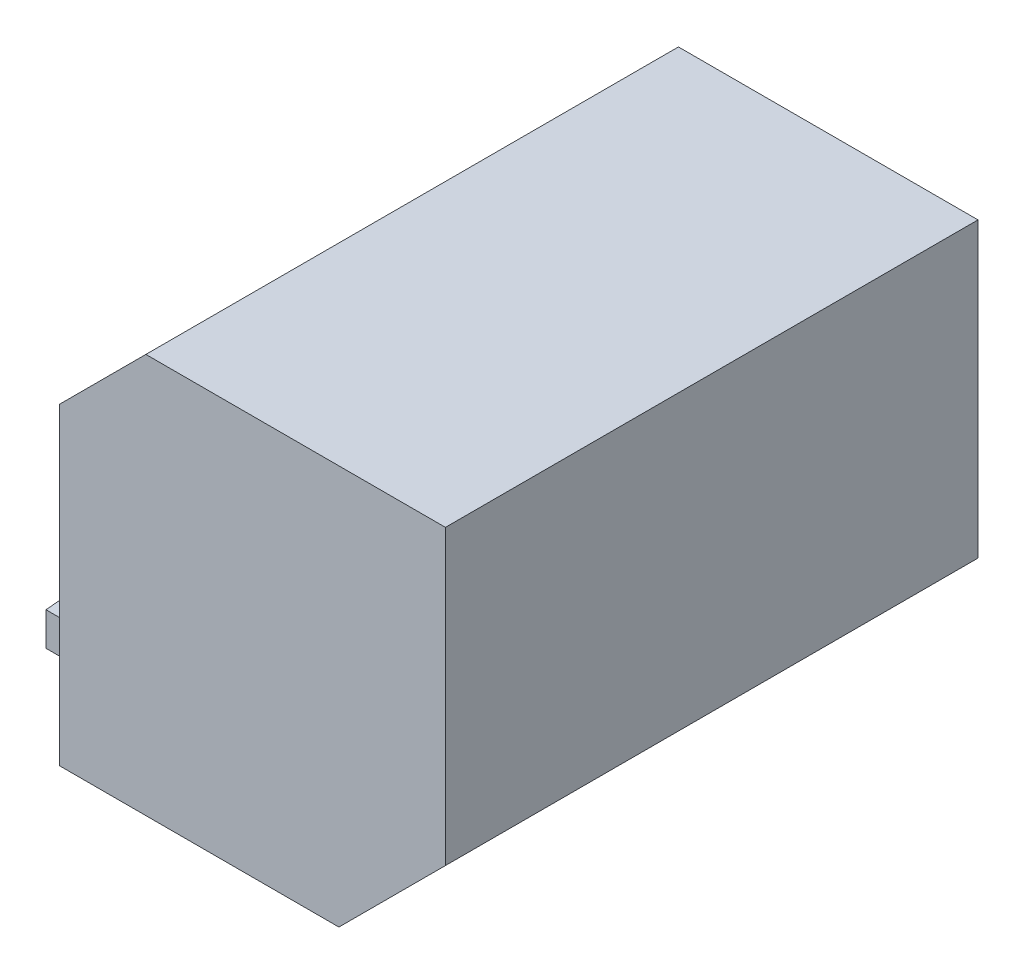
ISO-10303-21;
HEADER;
FILE_DESCRIPTION(('STEP AP214'),'2;1');
FILE_NAME('part.step','',(''),(''),'','','');
FILE_SCHEMA(('AUTOMOTIVE_DESIGN { 1 0 10303 214 1 1 1 1 }'));
ENDSEC;
DATA;
#1=APPLICATION_CONTEXT('core data for automotive mechanical design processes');
#2=APPLICATION_PROTOCOL_DEFINITION('international standard','automotive_design',2000,#1);
#3=PRODUCT_CONTEXT('',#1,'mechanical');
#4=PRODUCT('Part','Part','',(#3));
#5=PRODUCT_RELATED_PRODUCT_CATEGORY('part','',(#4));
#6=PRODUCT_DEFINITION_FORMATION('','',#4);
#7=PRODUCT_DEFINITION_CONTEXT('part definition',#1,'design');
#8=PRODUCT_DEFINITION('design','',#6,#7);
#9=PRODUCT_DEFINITION_SHAPE('','',#8);
#10=(LENGTH_UNIT() NAMED_UNIT(*) SI_UNIT(.MILLI.,.METRE.));
#11=(NAMED_UNIT(*) PLANE_ANGLE_UNIT() SI_UNIT($,.RADIAN.));
#12=(NAMED_UNIT(*) SI_UNIT($,.STERADIAN.) SOLID_ANGLE_UNIT());
#13=UNCERTAINTY_MEASURE_WITH_UNIT(LENGTH_MEASURE(1.E-05),#10,'distance_accuracy_value','');
#14=(GEOMETRIC_REPRESENTATION_CONTEXT(3) GLOBAL_UNCERTAINTY_ASSIGNED_CONTEXT((#13)) GLOBAL_UNIT_ASSIGNED_CONTEXT((#10,
#11,#12)) REPRESENTATION_CONTEXT('',''));
#15=CARTESIAN_POINT('',(0.,0.,0.));
#16=DIRECTION('',(0.,0.,1.));
#17=DIRECTION('',(1.,0.,0.));
#18=AXIS2_PLACEMENT_3D('',#15,#16,#17);
#19=CARTESIAN_POINT('',(5.,10.9965009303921,26.1199155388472));
#20=DIRECTION('',(0.,-0.995396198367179,-0.0958457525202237));
#21=DIRECTION('',(0.,0.0958457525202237,-0.995396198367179));
#22=AXIS2_PLACEMENT_3D('',#19,#20,#21);
#23=CYLINDRICAL_SURFACE('',#22,2.);
#24=CARTESIAN_POINT('',(5.,13.4849914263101,26.3595299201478));
#25=DIRECTION('',(0.,-0.995396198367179,-0.0958457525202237));
#26=DIRECTION('',(0.,0.0958457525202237,-0.995396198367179));
#27=AXIS2_PLACEMENT_3D('',#24,#25,#26);
#28=CIRCLE('',#27,2.);
#29=CARTESIAN_POINT('',(5.,13.6766829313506,24.3687375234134));
#30=VERTEX_POINT('',#29);
#31=EDGE_CURVE('E222',#30,#30,#28,.F.);
#32=ORIENTED_EDGE('',*,*,#31,.T.);
#33=EDGE_LOOP('',(#32));
#34=FACE_BOUND('',#33,.T.);
#35=CARTESIAN_POINT('',(5.,8.5080104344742,25.8803011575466));
#36=DIRECTION('',(0.,-0.995396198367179,-0.0958457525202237));
#37=DIRECTION('',(0.,0.0958457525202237,-0.995396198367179));
#38=AXIS2_PLACEMENT_3D('',#35,#36,#37);
#39=CIRCLE('',#38,2.);
#40=CARTESIAN_POINT('',(5.,8.69970193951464,23.8895087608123));
#41=VERTEX_POINT('',#40);
#42=EDGE_CURVE('E235',#41,#41,#39,.T.);
#43=ORIENTED_EDGE('',*,*,#42,.T.);
#44=EDGE_LOOP('',(#43));
#45=FACE_BOUND('',#44,.T.);
#46=ADVANCED_FACE('F17',(#34,#45),#23,.F.);
#47=CARTESIAN_POINT('',(5.,8.12112835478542,55.9818014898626));
#48=DIRECTION('',(0.,-0.995396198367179,-0.0958457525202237));
#49=DIRECTION('',(0.,0.0958457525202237,-0.995396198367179));
#50=AXIS2_PLACEMENT_3D('',#47,#48,#49);
#51=CYLINDRICAL_SURFACE('',#50,2.);
#52=CARTESIAN_POINT('',(5.,10.6096188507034,56.2214158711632));
#53=DIRECTION('',(0.,-0.995396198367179,-0.0958457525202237));
#54=DIRECTION('',(0.,0.0958457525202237,-0.995396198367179));
#55=AXIS2_PLACEMENT_3D('',#52,#53,#54);
#56=CIRCLE('',#55,2.);
#57=CARTESIAN_POINT('',(5.,10.8013103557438,54.2306234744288));
#58=VERTEX_POINT('',#57);
#59=EDGE_CURVE('E199',#58,#58,#56,.F.);
#60=ORIENTED_EDGE('',*,*,#59,.T.);
#61=EDGE_LOOP('',(#60));
#62=FACE_BOUND('',#61,.T.);
#63=CARTESIAN_POINT('',(5.,5.63263785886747,55.742187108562));
#64=DIRECTION('',(0.,-0.995396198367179,-0.0958457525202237));
#65=DIRECTION('',(0.,0.0958457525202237,-0.995396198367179));
#66=AXIS2_PLACEMENT_3D('',#63,#64,#65);
#67=CIRCLE('',#66,2.);
#68=CARTESIAN_POINT('',(5.,5.82432936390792,53.7513947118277));
#69=VERTEX_POINT('',#68);
#70=EDGE_CURVE('E20',#69,#69,#67,.T.);
#71=ORIENTED_EDGE('',*,*,#70,.T.);
#72=EDGE_LOOP('',(#71));
#73=FACE_BOUND('',#72,.T.);
#74=ADVANCED_FACE('F272',(#62,#73),#51,.F.);
#75=CARTESIAN_POINT('',(0.,60.,0.));
#76=DIRECTION('',(-1.,0.,0.));
#77=DIRECTION('',(0.,0.,1.));
#78=AXIS2_PLACEMENT_3D('',#75,#76,#77);
#79=PLANE('',#78);
#80=DIRECTION('',(0.,1.,0.));
#81=VECTOR('',#80,1.);
#82=CARTESIAN_POINT('',(0.,0.,70.));
#83=LINE('',#82,#81);
#84=CARTESIAN_POINT('',(0.,4.25976662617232,70.));
#85=VERTEX_POINT('',#84);
#86=CARTESIAN_POINT('',(0.,9.28289209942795,70.));
#87=VERTEX_POINT('',#86);
#88=EDGE_CURVE('E215',#85,#87,#83,.T.);
#89=ORIENTED_EDGE('',*,*,#88,.T.);
#90=DIRECTION('',(0.,0.0958457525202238,-0.995396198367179));
#91=VECTOR('',#90,1.);
#92=CARTESIAN_POINT('',(0.,7.61909765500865,87.2791659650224));
#93=LINE('',#92,#91);
#94=CARTESIAN_POINT('',(0.,15.9769809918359,0.479228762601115));
#95=VERTEX_POINT('',#94);
#96=EDGE_CURVE('E209',#87,#95,#93,.T.);
#97=ORIENTED_EDGE('',*,*,#96,.T.);
#98=DIRECTION('',(0.,-0.995396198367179,-0.0958457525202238));
#99=VECTOR('',#98,1.);
#100=CARTESIAN_POINT('',(0.,15.9769809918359,0.479228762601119));
#101=LINE('',#100,#99);
#102=CARTESIAN_POINT('',(0.,11.,0.));
#103=VERTEX_POINT('',#102);
#104=EDGE_CURVE('E150',#95,#103,#101,.T.);
#105=ORIENTED_EDGE('',*,*,#104,.T.);
#106=DIRECTION('',(0.,-0.0958457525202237,0.995396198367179));
#107=VECTOR('',#106,1.);
#108=CARTESIAN_POINT('',(0.,11.,0.));
#109=LINE('',#108,#107);
#110=EDGE_CURVE('E229',#103,#85,#109,.T.);
#111=ORIENTED_EDGE('',*,*,#110,.T.);
#112=EDGE_LOOP('',(#89,#97,#105,#111));
#113=FACE_BOUND('',#112,.T.);
#114=ADVANCED_FACE('F278',(#113),#79,.T.);
#115=CARTESIAN_POINT('',(0.,11.,0.));
#116=DIRECTION('',(0.,0.995396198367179,0.0958457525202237));
#117=DIRECTION('',(0.,-0.0958457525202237,0.995396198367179));
#118=AXIS2_PLACEMENT_3D('',#115,#116,#117);
#119=PLANE('',#118);
#120=ORIENTED_EDGE('',*,*,#42,.F.);
#121=EDGE_LOOP('',(#120));
#122=FACE_BOUND('',#121,.T.);
#123=ORIENTED_EDGE('',*,*,#70,.F.);
#124=EDGE_LOOP('',(#123));
#125=FACE_BOUND('',#124,.T.);
#126=DIRECTION('',(1.,0.,0.));
#127=VECTOR('',#126,1.);
#128=CARTESIAN_POINT('',(0.,11.,0.));
#129=LINE('',#128,#127);
#130=CARTESIAN_POINT('',(12.,11.,0.));
#131=VERTEX_POINT('',#130);
#132=EDGE_CURVE('E195',#103,#131,#129,.T.);
#133=ORIENTED_EDGE('',*,*,#132,.T.);
#134=DIRECTION('',(0.,-0.0958457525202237,0.995396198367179));
#135=VECTOR('',#134,1.);
#136=CARTESIAN_POINT('',(12.,11.,0.));
#137=LINE('',#136,#135);
#138=CARTESIAN_POINT('',(12.,4.25976662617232,70.));
#139=VERTEX_POINT('',#138);
#140=EDGE_CURVE('E256',#131,#139,#137,.T.);
#141=ORIENTED_EDGE('',*,*,#140,.T.);
#142=DIRECTION('',(1.,0.,0.));
#143=VECTOR('',#142,1.);
#144=CARTESIAN_POINT('',(0.,4.25976662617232,70.));
#145=LINE('',#144,#143);
#146=EDGE_CURVE('E210',#139,#85,#145,.F.);
#147=ORIENTED_EDGE('',*,*,#146,.T.);
#148=ORIENTED_EDGE('',*,*,#110,.F.);
#149=EDGE_LOOP('',(#133,#141,#147,#148));
#150=FACE_BOUND('',#149,.T.);
#151=ADVANCED_FACE('F274',(#122,#125,#150),#119,.F.);
#152=CARTESIAN_POINT('',(0.,0.,70.));
#153=DIRECTION('',(0.,0.,-1.));
#154=DIRECTION('',(0.,1.,0.));
#155=AXIS2_PLACEMENT_3D('',#152,#153,#154);
#156=PLANE('',#155);
#157=DIRECTION('',(0.,1.,0.));
#158=VECTOR('',#157,1.);
#159=CARTESIAN_POINT('',(12.,0.,70.));
#160=LINE('',#159,#158);
#161=CARTESIAN_POINT('',(12.,9.28289209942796,70.));
#162=VERTEX_POINT('',#161);
#163=EDGE_CURVE('E253',#139,#162,#160,.T.);
#164=ORIENTED_EDGE('',*,*,#163,.T.);
#165=DIRECTION('',(1.,0.,0.));
#166=VECTOR('',#165,1.);
#167=CARTESIAN_POINT('',(0.,9.28289209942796,70.));
#168=LINE('',#167,#166);
#169=EDGE_CURVE('E206',#162,#87,#168,.F.);
#170=ORIENTED_EDGE('',*,*,#169,.T.);
#171=ORIENTED_EDGE('',*,*,#88,.F.);
#172=ORIENTED_EDGE('',*,*,#146,.F.);
#173=EDGE_LOOP('',(#164,#170,#171,#172));
#174=FACE_BOUND('',#173,.T.);
#175=ADVANCED_FACE('F277',(#174),#156,.F.);
#176=CARTESIAN_POINT('',(0.,7.61909765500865,87.2791659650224));
#177=DIRECTION('',(0.,-0.995396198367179,-0.0958457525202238));
#178=DIRECTION('',(0.,0.0958457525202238,-0.995396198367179));
#179=AXIS2_PLACEMENT_3D('',#176,#177,#178);
#180=PLANE('',#179);
#181=ORIENTED_EDGE('',*,*,#59,.F.);
#182=EDGE_LOOP('',(#181));
#183=FACE_BOUND('',#182,.T.);
#184=ORIENTED_EDGE('',*,*,#31,.F.);
#185=EDGE_LOOP('',(#184));
#186=FACE_BOUND('',#185,.T.);
#187=ORIENTED_EDGE('',*,*,#96,.F.);
#188=ORIENTED_EDGE('',*,*,#169,.F.);
#189=DIRECTION('',(0.,0.0958457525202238,-0.995396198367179));
#190=VECTOR('',#189,1.);
#191=CARTESIAN_POINT('',(12.,7.61909765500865,87.2791659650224));
#192=LINE('',#191,#190);
#193=CARTESIAN_POINT('',(12.,15.9769809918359,0.479228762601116));
#194=VERTEX_POINT('',#193);
#195=EDGE_CURVE('E250',#162,#194,#192,.T.);
#196=ORIENTED_EDGE('',*,*,#195,.T.);
#197=DIRECTION('',(1.,0.,0.));
#198=VECTOR('',#197,1.);
#199=CARTESIAN_POINT('',(0.,15.9769809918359,0.479228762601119));
#200=LINE('',#199,#198);
#201=EDGE_CURVE('E198',#194,#95,#200,.F.);
#202=ORIENTED_EDGE('',*,*,#201,.T.);
#203=EDGE_LOOP('',(#187,#188,#196,#202));
#204=FACE_BOUND('',#203,.T.);
#205=ADVANCED_FACE('F291',(#183,#186,#204),#180,.F.);
#206=CARTESIAN_POINT('',(0.,15.9769809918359,0.479228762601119));
#207=DIRECTION('',(0.,-0.0958457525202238,0.995396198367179));
#208=DIRECTION('',(0.,-0.995396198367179,-0.0958457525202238));
#209=AXIS2_PLACEMENT_3D('',#206,#207,#208);
#210=PLANE('',#209);
#211=ORIENTED_EDGE('',*,*,#201,.F.);
#212=DIRECTION('',(0.,-0.995396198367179,-0.0958457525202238));
#213=VECTOR('',#212,1.);
#214=CARTESIAN_POINT('',(12.,15.9769809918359,0.479228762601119));
#215=LINE('',#214,#213);
#216=EDGE_CURVE('E189',#194,#131,#215,.T.);
#217=ORIENTED_EDGE('',*,*,#216,.T.);
#218=ORIENTED_EDGE('',*,*,#132,.F.);
#219=ORIENTED_EDGE('',*,*,#104,.F.);
#220=EDGE_LOOP('',(#211,#217,#218,#219));
#221=FACE_BOUND('',#220,.T.);
#222=ADVANCED_FACE('F285',(#221),#210,.F.);
#223=CARTESIAN_POINT('',(35.,30.,80.));
#224=DIRECTION('',(0.,0.,1.));
#225=DIRECTION('',(1.,0.,0.));
#226=AXIS2_PLACEMENT_3D('',#223,#224,#225);
#227=PLANE('',#226);
#228=DIRECTION('',(0.,1.,0.));
#229=VECTOR('',#228,1.);
#230=CARTESIAN_POINT('',(70.,0.,80.));
#231=LINE('',#230,#229);
#232=CARTESIAN_POINT('',(70.,60.,80.));
#233=VERTEX_POINT('',#232);
#234=CARTESIAN_POINT('',(70.,16.,80.));
#235=VERTEX_POINT('',#234);
#236=EDGE_CURVE('E154',#233,#235,#231,.F.);
#237=ORIENTED_EDGE('',*,*,#236,.F.);
#238=DIRECTION('',(1.,0.,0.));
#239=VECTOR('',#238,1.);
#240=CARTESIAN_POINT('',(70.,60.,80.));
#241=LINE('',#240,#239);
#242=CARTESIAN_POINT('',(25.,60.,80.));
#243=VERTEX_POINT('',#242);
#244=EDGE_CURVE('E134',#243,#233,#241,.T.);
#245=ORIENTED_EDGE('',*,*,#244,.F.);
#246=DIRECTION('',(-0.707106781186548,-0.707106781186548,0.));
#247=VECTOR('',#246,1.);
#248=CARTESIAN_POINT('',(15.,50.,80.));
#249=LINE('',#248,#247);
#250=CARTESIAN_POINT('',(12.,47.,80.));
#251=VERTEX_POINT('',#250);
#252=EDGE_CURVE('E124',#251,#243,#249,.F.);
#253=ORIENTED_EDGE('',*,*,#252,.F.);
#254=DIRECTION('',(0.,1.,0.));
#255=VECTOR('',#254,1.);
#256=CARTESIAN_POINT('',(12.,30.,80.));
#257=LINE('',#256,#255);
#258=CARTESIAN_POINT('',(12.,0.,80.));
#259=VERTEX_POINT('',#258);
#260=EDGE_CURVE('E110',#251,#259,#257,.F.);
#261=ORIENTED_EDGE('',*,*,#260,.T.);
#262=DIRECTION('',(1.,0.,0.));
#263=VECTOR('',#262,1.);
#264=CARTESIAN_POINT('',(0.,0.,80.));
#265=LINE('',#264,#263);
#266=CARTESIAN_POINT('',(54.,0.,80.));
#267=VERTEX_POINT('',#266);
#268=EDGE_CURVE('E186',#267,#259,#265,.F.);
#269=ORIENTED_EDGE('',*,*,#268,.F.);
#270=DIRECTION('',(0.707106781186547,0.707106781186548,0.));
#271=VECTOR('',#270,1.);
#272=CARTESIAN_POINT('',(62.,8.,80.));
#273=LINE('',#272,#271);
#274=EDGE_CURVE('E170',#235,#267,#273,.F.);
#275=ORIENTED_EDGE('',*,*,#274,.F.);
#276=EDGE_LOOP('',(#237,#245,#253,#261,#269,#275));
#277=FACE_BOUND('',#276,.T.);
#278=ADVANCED_FACE('F133',(#277),#227,.T.);
#279=CARTESIAN_POINT('',(0.,0.,70.));
#280=DIRECTION('',(0.,0.,-1.));
#281=DIRECTION('',(0.,1.,0.));
#282=AXIS2_PLACEMENT_3D('',#279,#280,#281);
#283=PLANE('',#282);
#284=DIRECTION('',(0.,1.,0.));
#285=VECTOR('',#284,1.);
#286=CARTESIAN_POINT('',(5.,42.2733158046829,70.));
#287=LINE('',#286,#285);
#288=CARTESIAN_POINT('',(5.,40.,70.));
#289=VERTEX_POINT('',#288);
#290=CARTESIAN_POINT('',(5.,21.3383932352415,70.));
#291=VERTEX_POINT('',#290);
#292=EDGE_CURVE('E146',#289,#291,#287,.F.);
#293=ORIENTED_EDGE('',*,*,#292,.T.);
#294=DIRECTION('',(1.,0.,0.));
#295=VECTOR('',#294,1.);
#296=CARTESIAN_POINT('',(0.,21.3383932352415,70.));
#297=LINE('',#296,#295);
#298=CARTESIAN_POINT('',(12.,21.3383932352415,70.));
#299=VERTEX_POINT('',#298);
#300=EDGE_CURVE('E149',#291,#299,#297,.T.);
#301=ORIENTED_EDGE('',*,*,#300,.T.);
#302=DIRECTION('',(0.,1.,0.));
#303=VECTOR('',#302,1.);
#304=CARTESIAN_POINT('',(12.,0.,70.));
#305=LINE('',#304,#303);
#306=CARTESIAN_POINT('',(12.,47.,70.));
#307=VERTEX_POINT('',#306);
#308=EDGE_CURVE('E259',#299,#307,#305,.T.);
#309=ORIENTED_EDGE('',*,*,#308,.T.);
#310=DIRECTION('',(-0.707106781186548,-0.707106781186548,0.));
#311=VECTOR('',#310,1.);
#312=CARTESIAN_POINT('',(15.,50.,70.));
#313=LINE('',#312,#311);
#314=EDGE_CURVE('E128',#289,#307,#313,.F.);
#315=ORIENTED_EDGE('',*,*,#314,.F.);
#316=EDGE_LOOP('',(#293,#301,#309,#315));
#317=FACE_BOUND('',#316,.T.);
#318=ADVANCED_FACE('F349',(#317),#283,.F.);
#319=CARTESIAN_POINT('',(5.,42.2733158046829,36.1185425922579));
#320=DIRECTION('',(1.,0.,0.));
#321=DIRECTION('',(0.,0.,-1.));
#322=AXIS2_PLACEMENT_3D('',#319,#320,#321);
#323=PLANE('',#322);
#324=DIRECTION('',(0.,1.,0.));
#325=VECTOR('',#324,1.);
#326=CARTESIAN_POINT('',(5.,30.,0.));
#327=LINE('',#326,#325);
#328=CARTESIAN_POINT('',(5.,40.,0.));
#329=VERTEX_POINT('',#328);
#330=CARTESIAN_POINT('',(5.,28.0786266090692,0.));
#331=VERTEX_POINT('',#330);
#332=EDGE_CURVE('E130',#329,#331,#327,.F.);
#333=ORIENTED_EDGE('',*,*,#332,.T.);
#334=DIRECTION('',(0.,-0.0958457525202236,0.995396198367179));
#335=VECTOR('',#334,1.);
#336=CARTESIAN_POINT('',(5.,28.4544603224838,-3.90318234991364));
#337=LINE('',#336,#335);
#338=EDGE_CURVE('E121',#331,#291,#337,.T.);
#339=ORIENTED_EDGE('',*,*,#338,.T.);
#340=ORIENTED_EDGE('',*,*,#292,.F.);
#341=DIRECTION('',(0.,0.,1.));
#342=VECTOR('',#341,1.);
#343=CARTESIAN_POINT('',(5.,40.,18.0592712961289));
#344=LINE('',#343,#342);
#345=EDGE_CURVE('E137',#329,#289,#344,.T.);
#346=ORIENTED_EDGE('',*,*,#345,.F.);
#347=EDGE_LOOP('',(#333,#339,#340,#346));
#348=FACE_BOUND('',#347,.T.);
#349=ADVANCED_FACE('F345',(#348),#323,.F.);
#350=CARTESIAN_POINT('',(0.,28.4544603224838,-3.90318234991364));
#351=DIRECTION('',(0.,0.995396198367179,0.0958457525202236));
#352=DIRECTION('',(0.,-0.0958457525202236,0.995396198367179));
#353=AXIS2_PLACEMENT_3D('',#350,#351,#352);
#354=PLANE('',#353);
#355=DIRECTION('',(1.,0.,0.));
#356=VECTOR('',#355,1.);
#357=CARTESIAN_POINT('',(35.,28.0786266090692,0.));
#358=LINE('',#357,#356);
#359=CARTESIAN_POINT('',(12.,28.0786266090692,0.));
#360=VERTEX_POINT('',#359);
#361=EDGE_CURVE('E245',#331,#360,#358,.T.);
#362=ORIENTED_EDGE('',*,*,#361,.T.);
#363=DIRECTION('',(0.,-0.0958457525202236,0.995396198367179));
#364=VECTOR('',#363,1.);
#365=CARTESIAN_POINT('',(12.,28.4544603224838,-3.90318234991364));
#366=LINE('',#365,#364);
#367=EDGE_CURVE('E120',#360,#299,#366,.T.);
#368=ORIENTED_EDGE('',*,*,#367,.T.);
#369=ORIENTED_EDGE('',*,*,#300,.F.);
#370=ORIENTED_EDGE('',*,*,#338,.F.);
#371=EDGE_LOOP('',(#362,#368,#369,#370));
#372=FACE_BOUND('',#371,.T.);
#373=ADVANCED_FACE('F342',(#372),#354,.F.);
#374=CARTESIAN_POINT('',(12.,3.89588081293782,33.4837201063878));
#375=DIRECTION('',(1.,0.,0.));
#376=DIRECTION('',(0.,0.,-1.));
#377=AXIS2_PLACEMENT_3D('',#374,#375,#376);
#378=PLANE('',#377);
#379=ORIENTED_EDGE('',*,*,#195,.F.);
#380=ORIENTED_EDGE('',*,*,#163,.F.);
#381=ORIENTED_EDGE('',*,*,#140,.F.);
#382=ORIENTED_EDGE('',*,*,#216,.F.);
#383=EDGE_LOOP('',(#379,#380,#381,#382));
#384=FACE_BOUND('',#383,.T.);
#385=ORIENTED_EDGE('',*,*,#308,.F.);
#386=ORIENTED_EDGE('',*,*,#367,.F.);
#387=DIRECTION('',(0.,1.,0.));
#388=VECTOR('',#387,1.);
#389=CARTESIAN_POINT('',(12.,3.89588081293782,0.));
#390=LINE('',#389,#388);
#391=CARTESIAN_POINT('',(12.,0.,0.));
#392=VERTEX_POINT('',#391);
#393=EDGE_CURVE('E244',#360,#392,#390,.F.);
#394=ORIENTED_EDGE('',*,*,#393,.T.);
#395=DIRECTION('',(0.,0.,-1.));
#396=VECTOR('',#395,1.);
#397=CARTESIAN_POINT('',(12.,0.,0.));
#398=LINE('',#397,#396);
#399=EDGE_CURVE('E116',#259,#392,#398,.T.);
#400=ORIENTED_EDGE('',*,*,#399,.F.);
#401=ORIENTED_EDGE('',*,*,#260,.F.);
#402=DIRECTION('',(0.,0.,1.));
#403=VECTOR('',#402,1.);
#404=CARTESIAN_POINT('',(12.,47.,18.0592712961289));
#405=LINE('',#404,#403);
#406=EDGE_CURVE('E114',#307,#251,#405,.T.);
#407=ORIENTED_EDGE('',*,*,#406,.F.);
#408=EDGE_LOOP('',(#385,#386,#394,#400,#401,#407));
#409=FACE_BOUND('',#408,.T.);
#410=ADVANCED_FACE('F113',(#384,#409),#378,.F.);
#411=CARTESIAN_POINT('',(0.,0.,0.));
#412=DIRECTION('',(0.,-1.,0.));
#413=DIRECTION('',(0.,0.,-1.));
#414=AXIS2_PLACEMENT_3D('',#411,#412,#413);
#415=PLANE('',#414);
#416=ORIENTED_EDGE('',*,*,#399,.T.);
#417=DIRECTION('',(1.,0.,0.));
#418=VECTOR('',#417,1.);
#419=CARTESIAN_POINT('',(35.,0.,0.));
#420=LINE('',#419,#418);
#421=CARTESIAN_POINT('',(54.,0.,0.));
#422=VERTEX_POINT('',#421);
#423=EDGE_CURVE('E183',#392,#422,#420,.T.);
#424=ORIENTED_EDGE('',*,*,#423,.T.);
#425=DIRECTION('',(0.,0.,1.));
#426=VECTOR('',#425,1.);
#427=CARTESIAN_POINT('',(54.,0.,0.));
#428=LINE('',#427,#426);
#429=EDGE_CURVE('E167',#267,#422,#428,.F.);
#430=ORIENTED_EDGE('',*,*,#429,.F.);
#431=ORIENTED_EDGE('',*,*,#268,.T.);
#432=EDGE_LOOP('',(#416,#424,#430,#431));
#433=FACE_BOUND('',#432,.T.);
#434=ADVANCED_FACE('F335',(#433),#415,.T.);
#435=CARTESIAN_POINT('',(62.,8.,0.));
#436=DIRECTION('',(0.707106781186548,-0.707106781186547,0.));
#437=DIRECTION('',(0.707106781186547,0.707106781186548,0.));
#438=AXIS2_PLACEMENT_3D('',#435,#436,#437);
#439=PLANE('',#438);
#440=DIRECTION('',(0.707106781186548,0.707106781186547,0.));
#441=VECTOR('',#440,1.);
#442=CARTESIAN_POINT('',(54.,0.,0.));
#443=LINE('',#442,#441);
#444=CARTESIAN_POINT('',(70.,16.,0.));
#445=VERTEX_POINT('',#444);
#446=EDGE_CURVE('E178',#422,#445,#443,.T.);
#447=ORIENTED_EDGE('',*,*,#446,.T.);
#448=DIRECTION('',(0.,0.,-1.));
#449=VECTOR('',#448,1.);
#450=CARTESIAN_POINT('',(70.,16.,0.));
#451=LINE('',#450,#449);
#452=EDGE_CURVE('E161',#235,#445,#451,.T.);
#453=ORIENTED_EDGE('',*,*,#452,.F.);
#454=ORIENTED_EDGE('',*,*,#274,.T.);
#455=ORIENTED_EDGE('',*,*,#429,.T.);
#456=EDGE_LOOP('',(#447,#453,#454,#455));
#457=FACE_BOUND('',#456,.T.);
#458=ADVANCED_FACE('F331',(#457),#439,.T.);
#459=CARTESIAN_POINT('',(70.,0.,0.));
#460=DIRECTION('',(1.,0.,0.));
#461=DIRECTION('',(0.,0.,-1.));
#462=AXIS2_PLACEMENT_3D('',#459,#460,#461);
#463=PLANE('',#462);
#464=DIRECTION('',(0.,0.,1.));
#465=VECTOR('',#464,1.);
#466=CARTESIAN_POINT('',(70.,60.,0.));
#467=LINE('',#466,#465);
#468=CARTESIAN_POINT('',(70.,60.,0.));
#469=VERTEX_POINT('',#468);
#470=EDGE_CURVE('E135',#233,#469,#467,.F.);
#471=ORIENTED_EDGE('',*,*,#470,.F.);
#472=ORIENTED_EDGE('',*,*,#236,.T.);
#473=ORIENTED_EDGE('',*,*,#452,.T.);
#474=DIRECTION('',(0.,1.,0.));
#475=VECTOR('',#474,1.);
#476=CARTESIAN_POINT('',(70.,30.,0.));
#477=LINE('',#476,#475);
#478=EDGE_CURVE('E174',#445,#469,#477,.T.);
#479=ORIENTED_EDGE('',*,*,#478,.T.);
#480=EDGE_LOOP('',(#471,#472,#473,#479));
#481=FACE_BOUND('',#480,.T.);
#482=ADVANCED_FACE('F327',(#481),#463,.T.);
#483=CARTESIAN_POINT('',(70.,60.,0.));
#484=DIRECTION('',(0.,1.,0.));
#485=DIRECTION('',(0.,0.,1.));
#486=AXIS2_PLACEMENT_3D('',#483,#484,#485);
#487=PLANE('',#486);
#488=ORIENTED_EDGE('',*,*,#470,.T.);
#489=DIRECTION('',(1.,0.,0.));
#490=VECTOR('',#489,1.);
#491=CARTESIAN_POINT('',(35.,60.,0.));
#492=LINE('',#491,#490);
#493=CARTESIAN_POINT('',(25.,60.,0.));
#494=VERTEX_POINT('',#493);
#495=EDGE_CURVE('E177',#469,#494,#492,.F.);
#496=ORIENTED_EDGE('',*,*,#495,.T.);
#497=DIRECTION('',(0.,0.,1.));
#498=VECTOR('',#497,1.);
#499=CARTESIAN_POINT('',(25.,60.,18.0592712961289));
#500=LINE('',#499,#498);
#501=EDGE_CURVE('E35',#243,#494,#500,.F.);
#502=ORIENTED_EDGE('',*,*,#501,.F.);
#503=ORIENTED_EDGE('',*,*,#244,.T.);
#504=EDGE_LOOP('',(#488,#496,#502,#503));
#505=FACE_BOUND('',#504,.T.);
#506=ADVANCED_FACE('F324',(#505),#487,.T.);
#507=CARTESIAN_POINT('',(15.,50.,18.0592712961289));
#508=DIRECTION('',(-0.707106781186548,0.707106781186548,0.));
#509=DIRECTION('',(-0.707106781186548,-0.707106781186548,0.));
#510=AXIS2_PLACEMENT_3D('',#507,#508,#509);
#511=PLANE('',#510);
#512=ORIENTED_EDGE('',*,*,#314,.T.);
#513=ORIENTED_EDGE('',*,*,#406,.T.);
#514=ORIENTED_EDGE('',*,*,#252,.T.);
#515=ORIENTED_EDGE('',*,*,#501,.T.);
#516=DIRECTION('',(-0.707106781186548,-0.707106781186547,0.));
#517=VECTOR('',#516,1.);
#518=CARTESIAN_POINT('',(25.,60.,0.));
#519=LINE('',#518,#517);
#520=EDGE_CURVE('E243',#494,#329,#519,.T.);
#521=ORIENTED_EDGE('',*,*,#520,.T.);
#522=ORIENTED_EDGE('',*,*,#345,.T.);
#523=EDGE_LOOP('',(#512,#513,#514,#515,#521,#522));
#524=FACE_BOUND('',#523,.T.);
#525=ADVANCED_FACE('F123',(#524),#511,.T.);
#526=CARTESIAN_POINT('',(35.,30.,0.));
#527=DIRECTION('',(0.,0.,1.));
#528=DIRECTION('',(1.,0.,0.));
#529=AXIS2_PLACEMENT_3D('',#526,#527,#528);
#530=PLANE('',#529);
#531=CARTESIAN_POINT('',(40.,30.,4.87717505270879E-12));
#532=DIRECTION('',(0.,0.,-1.));
#533=DIRECTION('',(-1.,0.,0.));
#534=AXIS2_PLACEMENT_3D('',#531,#532,#533);
#535=CIRCLE('',#534,25.7735026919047);
#536=CARTESIAN_POINT('',(14.2264973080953,30.,4.87717505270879E-12));
#537=VERTEX_POINT('',#536);
#538=EDGE_CURVE('E240',#537,#537,#535,.F.);
#539=ORIENTED_EDGE('',*,*,#538,.T.);
#540=EDGE_LOOP('',(#539));
#541=FACE_BOUND('',#540,.T.);
#542=ORIENTED_EDGE('',*,*,#495,.F.);
#543=ORIENTED_EDGE('',*,*,#478,.F.);
#544=ORIENTED_EDGE('',*,*,#446,.F.);
#545=ORIENTED_EDGE('',*,*,#423,.F.);
#546=ORIENTED_EDGE('',*,*,#393,.F.);
#547=ORIENTED_EDGE('',*,*,#361,.F.);
#548=ORIENTED_EDGE('',*,*,#332,.F.);
#549=ORIENTED_EDGE('',*,*,#520,.F.);
#550=EDGE_LOOP('',(#542,#543,#544,#545,#546,#547,#548,#549));
#551=FACE_BOUND('',#550,.T.);
#552=ADVANCED_FACE('F317',(#541,#551),#530,.F.);
#553=CARTESIAN_POINT('',(40.,30.,50.));
#554=DIRECTION('',(0.,0.,-1.));
#555=DIRECTION('',(-1.,0.,0.));
#556=AXIS2_PLACEMENT_3D('',#553,#554,#555);
#557=PLANE('',#556);
#558=CARTESIAN_POINT('',(40.,30.,50.));
#559=DIRECTION('',(0.,0.,-1.));
#560=DIRECTION('',(-1.,0.,0.));
#561=AXIS2_PLACEMENT_3D('',#558,#559,#560);
#562=CIRCLE('',#561,20.);
#563=CARTESIAN_POINT('',(20.,30.,50.));
#564=VERTEX_POINT('',#563);
#565=EDGE_CURVE('E26',#564,#564,#562,.T.);
#566=ORIENTED_EDGE('',*,*,#565,.T.);
#567=EDGE_LOOP('',(#566));
#568=FACE_BOUND('',#567,.T.);
#569=ADVANCED_FACE('F309',(#568),#557,.T.);
#570=CARTESIAN_POINT('',(40.,30.,4.87197088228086E-12));
#571=DIRECTION('',(0.,0.,-1.));
#572=DIRECTION('',(-1.,0.,0.));
#573=AXIS2_PLACEMENT_3D('',#570,#571,#572);
#574=CONICAL_SURFACE('',#573,25.7735026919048,0.5235987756);
#575=ORIENTED_EDGE('',*,*,#538,.F.);
#576=EDGE_LOOP('',(#575));
#577=FACE_BOUND('',#576,.T.);
#578=CARTESIAN_POINT('',(40.,30.,10.));
#579=DIRECTION('',(0.,0.,-1.));
#580=DIRECTION('',(-1.,0.,0.));
#581=AXIS2_PLACEMENT_3D('',#578,#579,#580);
#582=CIRCLE('',#581,20.);
#583=CARTESIAN_POINT('',(20.,30.,10.));
#584=VERTEX_POINT('',#583);
#585=EDGE_CURVE('E11',#584,#584,#582,.F.);
#586=ORIENTED_EDGE('',*,*,#585,.T.);
#587=EDGE_LOOP('',(#586));
#588=FACE_BOUND('',#587,.T.);
#589=ADVANCED_FACE('F303',(#577,#588),#574,.F.);
#590=CARTESIAN_POINT('',(40.,30.,25.));
#591=DIRECTION('',(0.,0.,-1.));
#592=DIRECTION('',(-1.,0.,0.));
#593=AXIS2_PLACEMENT_3D('',#590,#591,#592);
#594=CYLINDRICAL_SURFACE('',#593,20.);
#595=ORIENTED_EDGE('',*,*,#585,.F.);
#596=EDGE_LOOP('',(#595));
#597=FACE_BOUND('',#596,.T.);
#598=ORIENTED_EDGE('',*,*,#565,.F.);
#599=EDGE_LOOP('',(#598));
#600=FACE_BOUND('',#599,.T.);
#601=ADVANCED_FACE('F301',(#597,#600),#594,.F.);
#602=CLOSED_SHELL('',(#46,#74,#114,#151,#175,#205,#222,#278,#318,#349,#373,#410,#434,#458,#482,
#506,#525,#552,#569,#589,#601));
#603=MANIFOLD_SOLID_BREP('B1',#602);
#604=ADVANCED_BREP_SHAPE_REPRESENTATION('',(#18,#603),#14);
#605=SHAPE_DEFINITION_REPRESENTATION(#9,#604);
ENDSEC;
END-ISO-10303-21;
